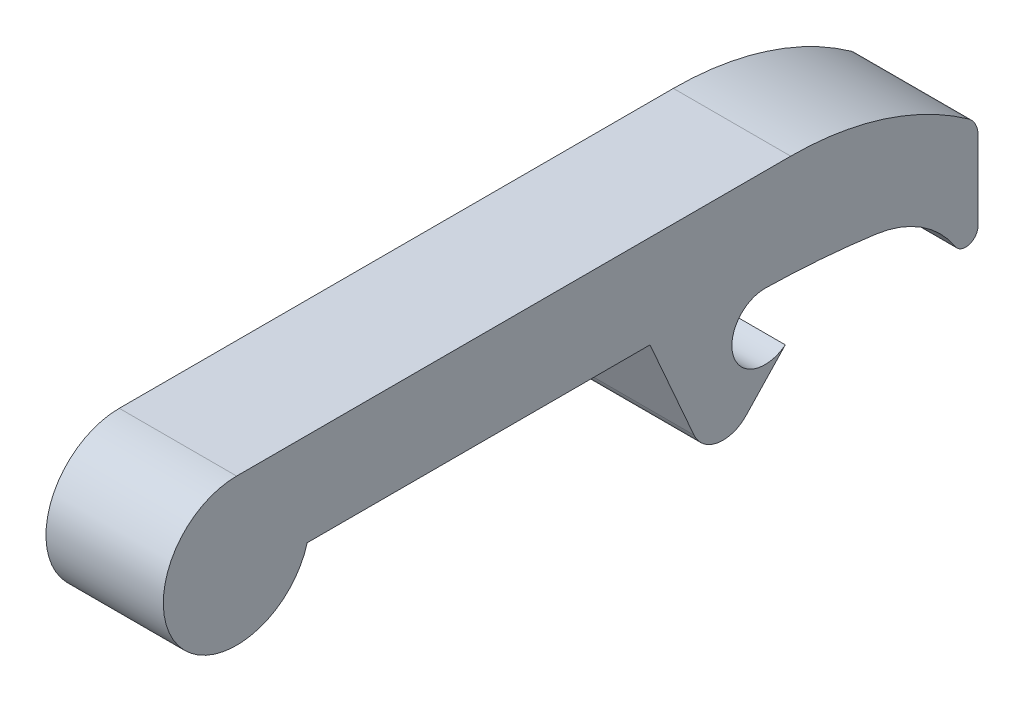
ISO-10303-21;
HEADER;
FILE_DESCRIPTION(('STEP AP214'),'2;1');
FILE_NAME('part.step','',(''),(''),'','','');
FILE_SCHEMA(('AUTOMOTIVE_DESIGN { 1 0 10303 214 1 1 1 1 }'));
ENDSEC;
DATA;
#1=APPLICATION_CONTEXT('core data for automotive mechanical design processes');
#2=APPLICATION_PROTOCOL_DEFINITION('international standard','automotive_design',2000,#1);
#3=PRODUCT_CONTEXT('',#1,'mechanical');
#4=PRODUCT('Part','Part','',(#3));
#5=PRODUCT_RELATED_PRODUCT_CATEGORY('part','',(#4));
#6=PRODUCT_DEFINITION_FORMATION('','',#4);
#7=PRODUCT_DEFINITION_CONTEXT('part definition',#1,'design');
#8=PRODUCT_DEFINITION('design','',#6,#7);
#9=PRODUCT_DEFINITION_SHAPE('','',#8);
#10=(LENGTH_UNIT() NAMED_UNIT(*) SI_UNIT(.MILLI.,.METRE.));
#11=(NAMED_UNIT(*) PLANE_ANGLE_UNIT() SI_UNIT($,.RADIAN.));
#12=(NAMED_UNIT(*) SI_UNIT($,.STERADIAN.) SOLID_ANGLE_UNIT());
#13=UNCERTAINTY_MEASURE_WITH_UNIT(LENGTH_MEASURE(1.E-05),#10,'distance_accuracy_value','');
#14=(GEOMETRIC_REPRESENTATION_CONTEXT(3) GLOBAL_UNCERTAINTY_ASSIGNED_CONTEXT((#13)) GLOBAL_UNIT_ASSIGNED_CONTEXT((#10,
#11,#12)) REPRESENTATION_CONTEXT('',''));
#15=CARTESIAN_POINT('',(0.,0.,0.));
#16=DIRECTION('',(0.,0.,1.));
#17=DIRECTION('',(1.,0.,0.));
#18=AXIS2_PLACEMENT_3D('',#15,#16,#17);
#19=CARTESIAN_POINT('',(31.75,-18.2904528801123,286.195239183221));
#20=DIRECTION('',(-1.,0.,0.));
#21=DIRECTION('',(0.,0.,1.));
#22=AXIS2_PLACEMENT_3D('',#19,#20,#21);
#23=CYLINDRICAL_SURFACE('',#22,39.6691923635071);
#24=CARTESIAN_POINT('',(-31.75,-18.2904528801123,286.195239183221));
#25=DIRECTION('',(1.,0.,0.));
#26=DIRECTION('',(0.,0.,-1.));
#27=AXIS2_PLACEMENT_3D('',#24,#25,#26);
#28=CIRCLE('',#27,39.6691923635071);
#29=CARTESIAN_POINT('',(-31.75,21.3787394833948,286.195239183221));
#30=VERTEX_POINT('',#29);
#31=CARTESIAN_POINT('',(-31.75,-28.9798226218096,247.99337800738));
#32=VERTEX_POINT('',#31);
#33=EDGE_CURVE('E159',#30,#32,#28,.T.);
#34=ORIENTED_EDGE('',*,*,#33,.T.);
#35=DIRECTION('',(-1.,0.,0.));
#36=VECTOR('',#35,1.);
#37=CARTESIAN_POINT('',(31.75,-28.9798226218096,247.99337800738));
#38=LINE('',#37,#36);
#39=CARTESIAN_POINT('',(31.75,-28.9798226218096,247.99337800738));
#40=VERTEX_POINT('',#39);
#41=EDGE_CURVE('E11',#40,#32,#38,.T.);
#42=ORIENTED_EDGE('',*,*,#41,.F.);
#43=CARTESIAN_POINT('',(31.75,-18.2904528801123,286.195239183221));
#44=DIRECTION('',(1.,0.,0.));
#45=DIRECTION('',(0.,0.,-1.));
#46=AXIS2_PLACEMENT_3D('',#43,#44,#45);
#47=CIRCLE('',#46,39.6691923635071);
#48=CARTESIAN_POINT('',(31.75,21.3787394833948,286.195239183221));
#49=VERTEX_POINT('',#48);
#50=EDGE_CURVE('E183',#49,#40,#47,.T.);
#51=ORIENTED_EDGE('',*,*,#50,.F.);
#52=DIRECTION('',(-1.,0.,0.));
#53=VECTOR('',#52,1.);
#54=CARTESIAN_POINT('',(31.75,21.3787394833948,286.195239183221));
#55=LINE('',#54,#53);
#56=EDGE_CURVE('E155',#49,#30,#55,.T.);
#57=ORIENTED_EDGE('',*,*,#56,.T.);
#58=EDGE_LOOP('',(#34,#42,#51,#57));
#59=FACE_BOUND('',#58,.T.);
#60=ADVANCED_FACE('F33',(#59),#23,.T.);
#61=CARTESIAN_POINT('',(31.75,-28.9798226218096,62.5236476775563));
#62=DIRECTION('',(0.,1.,0.));
#63=DIRECTION('',(0.,0.,1.));
#64=AXIS2_PLACEMENT_3D('',#61,#62,#63);
#65=PLANE('',#64);
#66=DIRECTION('',(0.,0.,-1.));
#67=VECTOR('',#66,1.);
#68=CARTESIAN_POINT('',(-31.75,-28.9798226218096,62.5236476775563));
#69=LINE('',#68,#67);
#70=CARTESIAN_POINT('',(-31.75,-28.9798226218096,62.5236476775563));
#71=VERTEX_POINT('',#70);
#72=EDGE_CURVE('E162',#32,#71,#69,.T.);
#73=ORIENTED_EDGE('',*,*,#72,.T.);
#74=DIRECTION('',(-1.,0.,0.));
#75=VECTOR('',#74,1.);
#76=CARTESIAN_POINT('',(31.75,-28.9798226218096,62.5236476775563));
#77=LINE('',#76,#75);
#78=CARTESIAN_POINT('',(31.75,-28.9798226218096,62.5236476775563));
#79=VERTEX_POINT('',#78);
#80=EDGE_CURVE('E41',#79,#71,#77,.T.);
#81=ORIENTED_EDGE('',*,*,#80,.F.);
#82=DIRECTION('',(0.,0.,-1.));
#83=VECTOR('',#82,1.);
#84=CARTESIAN_POINT('',(31.75,-28.9798226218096,62.5236476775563));
#85=LINE('',#84,#83);
#86=EDGE_CURVE('E107',#40,#79,#85,.T.);
#87=ORIENTED_EDGE('',*,*,#86,.F.);
#88=ORIENTED_EDGE('',*,*,#41,.T.);
#89=EDGE_LOOP('',(#73,#81,#87,#88));
#90=FACE_BOUND('',#89,.T.);
#91=ADVANCED_FACE('F266',(#90),#65,.F.);
#92=CARTESIAN_POINT('',(31.75,-83.2179374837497,38.6844172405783));
#93=DIRECTION('',(0.,0.40237741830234,-0.9154738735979));
#94=DIRECTION('',(0.,0.9154738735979,0.40237741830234));
#95=AXIS2_PLACEMENT_3D('',#92,#93,#94);
#96=PLANE('',#95);
#97=DIRECTION('',(0.,-0.9154738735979,-0.40237741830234));
#98=VECTOR('',#97,1.);
#99=CARTESIAN_POINT('',(-31.75,-83.2179374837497,38.6844172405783));
#100=LINE('',#99,#98);
#101=CARTESIAN_POINT('',(-31.75,-83.2179374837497,38.6844172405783));
#102=VERTEX_POINT('',#101);
#103=EDGE_CURVE('E164',#71,#102,#100,.T.);
#104=ORIENTED_EDGE('',*,*,#103,.T.);
#105=DIRECTION('',(-1.,0.,0.));
#106=VECTOR('',#105,1.);
#107=CARTESIAN_POINT('',(31.75,-83.2179374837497,38.6844172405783));
#108=LINE('',#107,#106);
#109=CARTESIAN_POINT('',(31.75,-83.2179374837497,38.6844172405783));
#110=VERTEX_POINT('',#109);
#111=EDGE_CURVE('E205',#110,#102,#108,.T.);
#112=ORIENTED_EDGE('',*,*,#111,.F.);
#113=DIRECTION('',(0.,-0.9154738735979,-0.40237741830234));
#114=VECTOR('',#113,1.);
#115=CARTESIAN_POINT('',(31.75,-83.2179374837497,38.6844172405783));
#116=LINE('',#115,#114);
#117=EDGE_CURVE('E213',#79,#110,#116,.T.);
#118=ORIENTED_EDGE('',*,*,#117,.F.);
#119=ORIENTED_EDGE('',*,*,#80,.T.);
#120=EDGE_LOOP('',(#104,#112,#118,#119));
#121=FACE_BOUND('',#120,.T.);
#122=ADVANCED_FACE('F211',(#121),#96,.F.);
#123=CARTESIAN_POINT('',(31.75,-76.3212880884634,22.9934215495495));
#124=DIRECTION('',(-1.,0.,0.));
#125=DIRECTION('',(0.,0.,1.));
#126=AXIS2_PLACEMENT_3D('',#123,#124,#125);
#127=CYLINDRICAL_SURFACE('',#126,17.1397525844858);
#128=CARTESIAN_POINT('',(-31.75,-76.3212880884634,22.9934215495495));
#129=DIRECTION('',(1.,0.,0.));
#130=DIRECTION('',(0.,0.,1.));
#131=AXIS2_PLACEMENT_3D('',#128,#129,#130);
#132=CIRCLE('',#131,17.1397525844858);
#133=CARTESIAN_POINT('',(-31.75,-88.0789591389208,10.5223233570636));
#134=VERTEX_POINT('',#133);
#135=EDGE_CURVE('E166',#102,#134,#132,.T.);
#136=ORIENTED_EDGE('',*,*,#135,.T.);
#137=DIRECTION('',(-1.,0.,0.));
#138=VECTOR('',#137,1.);
#139=CARTESIAN_POINT('',(31.75,-88.0789591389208,10.5223233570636));
#140=LINE('',#139,#138);
#141=CARTESIAN_POINT('',(31.75,-88.0789591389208,10.5223233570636));
#142=VERTEX_POINT('',#141);
#143=EDGE_CURVE('E202',#142,#134,#140,.T.);
#144=ORIENTED_EDGE('',*,*,#143,.F.);
#145=CARTESIAN_POINT('',(31.75,-76.3212880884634,22.9934215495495));
#146=DIRECTION('',(1.,0.,0.));
#147=DIRECTION('',(0.,0.,1.));
#148=AXIS2_PLACEMENT_3D('',#145,#146,#147);
#149=CIRCLE('',#148,17.1397525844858);
#150=EDGE_CURVE('E231',#110,#142,#149,.T.);
#151=ORIENTED_EDGE('',*,*,#150,.F.);
#152=ORIENTED_EDGE('',*,*,#111,.T.);
#153=EDGE_LOOP('',(#136,#144,#151,#152));
#154=FACE_BOUND('',#153,.T.);
#155=ADVANCED_FACE('F222',(#154),#127,.T.);
#156=CARTESIAN_POINT('',(31.75,-65.5801916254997,-10.6893697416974));
#157=DIRECTION('',(0.,0.685988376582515,0.727612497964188));
#158=DIRECTION('',(0.,-0.727612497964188,0.685988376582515));
#159=AXIS2_PLACEMENT_3D('',#156,#157,#158);
#160=PLANE('',#159);
#161=DIRECTION('',(0.,0.727612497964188,-0.685988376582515));
#162=VECTOR('',#161,1.);
#163=CARTESIAN_POINT('',(-31.75,-65.5801916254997,-10.6893697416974));
#164=LINE('',#163,#162);
#165=CARTESIAN_POINT('',(-31.75,-65.5801916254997,-10.6893697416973));
#166=VERTEX_POINT('',#165);
#167=EDGE_CURVE('E168',#134,#166,#164,.T.);
#168=ORIENTED_EDGE('',*,*,#167,.T.);
#169=DIRECTION('',(-1.,0.,0.));
#170=VECTOR('',#169,1.);
#171=CARTESIAN_POINT('',(31.75,-65.5801916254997,-10.6893697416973));
#172=LINE('',#171,#170);
#173=CARTESIAN_POINT('',(31.75,-65.5801916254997,-10.6893697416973));
#174=VERTEX_POINT('',#173);
#175=EDGE_CURVE('E199',#174,#166,#172,.T.);
#176=ORIENTED_EDGE('',*,*,#175,.F.);
#177=DIRECTION('',(0.,0.727612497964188,-0.685988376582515));
#178=VECTOR('',#177,1.);
#179=CARTESIAN_POINT('',(31.75,-65.5801916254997,-10.6893697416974));
#180=LINE('',#179,#178);
#181=EDGE_CURVE('E228',#142,#174,#180,.T.);
#182=ORIENTED_EDGE('',*,*,#181,.F.);
#183=ORIENTED_EDGE('',*,*,#143,.T.);
#184=EDGE_LOOP('',(#168,#176,#182,#183));
#185=FACE_BOUND('',#184,.T.);
#186=ADVANCED_FACE('F226',(#185),#160,.F.);
#187=CARTESIAN_POINT('',(31.75,-51.4973439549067,0.329066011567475));
#188=DIRECTION('',(-1.,0.,0.));
#189=DIRECTION('',(0.,0.,1.));
#190=AXIS2_PLACEMENT_3D('',#187,#188,#189);
#191=CYLINDRICAL_SURFACE('',#190,17.8810661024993);
#192=CARTESIAN_POINT('',(-31.75,-51.4973439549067,0.329066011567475));
#193=DIRECTION('',(-1.,0.,0.));
#194=DIRECTION('',(0.,0.,-1.));
#195=AXIS2_PLACEMENT_3D('',#192,#193,#194);
#196=CIRCLE('',#195,17.8810661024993);
#197=CARTESIAN_POINT('',(-31.75,-33.6193060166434,0.));
#198=VERTEX_POINT('',#197);
#199=EDGE_CURVE('E170',#166,#198,#196,.T.);
#200=ORIENTED_EDGE('',*,*,#199,.T.);
#201=DIRECTION('',(-1.,0.,0.));
#202=VECTOR('',#201,1.);
#203=CARTESIAN_POINT('',(31.75,-33.6193060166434,0.));
#204=LINE('',#203,#202);
#205=CARTESIAN_POINT('',(31.75,-33.6193060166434,0.));
#206=VERTEX_POINT('',#205);
#207=EDGE_CURVE('E196',#206,#198,#204,.T.);
#208=ORIENTED_EDGE('',*,*,#207,.F.);
#209=CARTESIAN_POINT('',(31.75,-51.4973439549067,0.329066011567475));
#210=DIRECTION('',(-1.,0.,0.));
#211=DIRECTION('',(0.,0.,-1.));
#212=AXIS2_PLACEMENT_3D('',#209,#210,#211);
#213=CIRCLE('',#212,17.8810661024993);
#214=EDGE_CURVE('E230',#174,#206,#213,.T.);
#215=ORIENTED_EDGE('',*,*,#214,.F.);
#216=ORIENTED_EDGE('',*,*,#175,.T.);
#217=EDGE_LOOP('',(#200,#208,#215,#216));
#218=FACE_BOUND('',#217,.T.);
#219=ADVANCED_FACE('F279',(#218),#191,.F.);
#220=CARTESIAN_POINT('',(31.75,-541.879675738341,9.35512125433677));
#221=DIRECTION('',(-1.,0.,0.));
#222=DIRECTION('',(0.,0.,1.));
#223=AXIS2_PLACEMENT_3D('',#220,#221,#222);
#224=CYLINDRICAL_SURFACE('',#223,508.346458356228);
#225=CARTESIAN_POINT('',(-31.75,-541.879675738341,9.35512125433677));
#226=DIRECTION('',(-1.,0.,0.));
#227=DIRECTION('',(0.,0.,-1.));
#228=AXIS2_PLACEMENT_3D('',#225,#226,#227);
#229=CIRCLE('',#228,508.346458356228);
#230=CARTESIAN_POINT('',(-31.75,-38.2587894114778,-59.7977859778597));
#231=VERTEX_POINT('',#230);
#232=EDGE_CURVE('E172',#198,#231,#229,.T.);
#233=ORIENTED_EDGE('',*,*,#232,.T.);
#234=DIRECTION('',(-1.,0.,0.));
#235=VECTOR('',#234,1.);
#236=CARTESIAN_POINT('',(31.75,-38.2587894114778,-59.7977859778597));
#237=LINE('',#236,#235);
#238=CARTESIAN_POINT('',(31.75,-38.2587894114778,-59.7977859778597));
#239=VERTEX_POINT('',#238);
#240=EDGE_CURVE('E193',#239,#231,#237,.T.);
#241=ORIENTED_EDGE('',*,*,#240,.F.);
#242=CARTESIAN_POINT('',(31.75,-541.879675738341,9.35512125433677));
#243=DIRECTION('',(-1.,0.,0.));
#244=DIRECTION('',(0.,0.,-1.));
#245=AXIS2_PLACEMENT_3D('',#242,#243,#244);
#246=CIRCLE('',#245,508.346458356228);
#247=EDGE_CURVE('E233',#206,#239,#246,.T.);
#248=ORIENTED_EDGE('',*,*,#247,.F.);
#249=ORIENTED_EDGE('',*,*,#207,.T.);
#250=EDGE_LOOP('',(#233,#241,#248,#249));
#251=FACE_BOUND('',#250,.T.);
#252=ADVANCED_FACE('F282',(#251),#224,.F.);
#253=CARTESIAN_POINT('',(31.75,-98.6662997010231,-51.503143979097));
#254=DIRECTION('',(-1.,0.,0.));
#255=DIRECTION('',(0.,0.,1.));
#256=AXIS2_PLACEMENT_3D('',#253,#254,#255);
#257=CYLINDRICAL_SURFACE('',#256,60.9743256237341);
#258=CARTESIAN_POINT('',(-31.75,-98.6662997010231,-51.503143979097));
#259=DIRECTION('',(-1.,0.,0.));
#260=DIRECTION('',(0.,0.,-1.));
#261=AXIS2_PLACEMENT_3D('',#258,#259,#260);
#262=CIRCLE('',#261,60.9743256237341);
#263=CARTESIAN_POINT('',(-31.75,-65.5801916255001,-102.720112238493));
#264=VERTEX_POINT('',#263);
#265=EDGE_CURVE('E174',#231,#264,#262,.T.);
#266=ORIENTED_EDGE('',*,*,#265,.T.);
#267=DIRECTION('',(-1.,0.,0.));
#268=VECTOR('',#267,1.);
#269=CARTESIAN_POINT('',(31.75,-65.5801916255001,-102.720112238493));
#270=LINE('',#269,#268);
#271=CARTESIAN_POINT('',(31.75,-65.5801916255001,-102.720112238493));
#272=VERTEX_POINT('',#271);
#273=EDGE_CURVE('E190',#272,#264,#270,.T.);
#274=ORIENTED_EDGE('',*,*,#273,.F.);
#275=CARTESIAN_POINT('',(31.75,-98.6662997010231,-51.503143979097));
#276=DIRECTION('',(-1.,0.,0.));
#277=DIRECTION('',(0.,0.,-1.));
#278=AXIS2_PLACEMENT_3D('',#275,#276,#277);
#279=CIRCLE('',#278,60.9743256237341);
#280=EDGE_CURVE('E239',#239,#272,#279,.T.);
#281=ORIENTED_EDGE('',*,*,#280,.F.);
#282=ORIENTED_EDGE('',*,*,#240,.T.);
#283=EDGE_LOOP('',(#266,#274,#281,#282));
#284=FACE_BOUND('',#283,.T.);
#285=ADVANCED_FACE('F286',(#284),#257,.F.);
#286=CARTESIAN_POINT('',(31.75,-61.9717045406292,-108.306014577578));
#287=DIRECTION('',(-1.,0.,0.));
#288=DIRECTION('',(0.,0.,1.));
#289=AXIS2_PLACEMENT_3D('',#286,#287,#288);
#290=CYLINDRICAL_SURFACE('',#289,6.65007398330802);
#291=CARTESIAN_POINT('',(-31.75,-61.9717045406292,-108.306014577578));
#292=DIRECTION('',(1.,0.,0.));
#293=DIRECTION('',(0.,0.,1.));
#294=AXIS2_PLACEMENT_3D('',#291,#292,#293);
#295=CIRCLE('',#294,6.65007398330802);
#296=CARTESIAN_POINT('',(-31.75,-61.9717045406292,-114.956088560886));
#297=VERTEX_POINT('',#296);
#298=EDGE_CURVE('E176',#264,#297,#295,.T.);
#299=ORIENTED_EDGE('',*,*,#298,.T.);
#300=DIRECTION('',(-1.,0.,0.));
#301=VECTOR('',#300,1.);
#302=CARTESIAN_POINT('',(31.75,-61.9717045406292,-114.956088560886));
#303=LINE('',#302,#301);
#304=CARTESIAN_POINT('',(31.75,-61.9717045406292,-114.956088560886));
#305=VERTEX_POINT('',#304);
#306=EDGE_CURVE('E187',#305,#297,#303,.T.);
#307=ORIENTED_EDGE('',*,*,#306,.F.);
#308=CARTESIAN_POINT('',(31.75,-61.9717045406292,-108.306014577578));
#309=DIRECTION('',(1.,0.,0.));
#310=DIRECTION('',(0.,0.,1.));
#311=AXIS2_PLACEMENT_3D('',#308,#309,#310);
#312=CIRCLE('',#311,6.65007398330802);
#313=EDGE_CURVE('E241',#272,#305,#312,.T.);
#314=ORIENTED_EDGE('',*,*,#313,.F.);
#315=ORIENTED_EDGE('',*,*,#273,.T.);
#316=EDGE_LOOP('',(#299,#307,#314,#315));
#317=FACE_BOUND('',#316,.T.);
#318=ADVANCED_FACE('F247',(#317),#290,.T.);
#319=CARTESIAN_POINT('',(31.75,-19.2578760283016,-114.956088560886));
#320=DIRECTION('',(0.,0.,1.));
#321=DIRECTION('',(0.,-1.,0.));
#322=AXIS2_PLACEMENT_3D('',#319,#320,#321);
#323=PLANE('',#322);
#324=DIRECTION('',(0.,1.,0.));
#325=VECTOR('',#324,1.);
#326=CARTESIAN_POINT('',(-31.75,-19.2578760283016,-114.956088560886));
#327=LINE('',#326,#325);
#328=CARTESIAN_POINT('',(-31.75,-19.2578760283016,-114.956088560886));
#329=VERTEX_POINT('',#328);
#330=EDGE_CURVE('E178',#297,#329,#327,.T.);
#331=ORIENTED_EDGE('',*,*,#330,.T.);
#332=DIRECTION('',(-1.,0.,0.));
#333=VECTOR('',#332,1.);
#334=CARTESIAN_POINT('',(31.75,-19.2578760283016,-114.956088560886));
#335=LINE('',#334,#333);
#336=CARTESIAN_POINT('',(31.75,-19.2578760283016,-114.956088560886));
#337=VERTEX_POINT('',#336);
#338=EDGE_CURVE('E150',#337,#329,#335,.T.);
#339=ORIENTED_EDGE('',*,*,#338,.F.);
#340=DIRECTION('',(0.,1.,0.));
#341=VECTOR('',#340,1.);
#342=CARTESIAN_POINT('',(31.75,-19.2578760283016,-114.956088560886));
#343=LINE('',#342,#341);
#344=EDGE_CURVE('E141',#305,#337,#343,.T.);
#345=ORIENTED_EDGE('',*,*,#344,.F.);
#346=ORIENTED_EDGE('',*,*,#306,.T.);
#347=EDGE_LOOP('',(#331,#339,#345,#346));
#348=FACE_BOUND('',#347,.T.);
#349=ADVANCED_FACE('F251',(#348),#323,.F.);
#350=CARTESIAN_POINT('',(31.75,-19.2578760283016,-102.720112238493));
#351=DIRECTION('',(-1.,0.,0.));
#352=DIRECTION('',(0.,0.,1.));
#353=AXIS2_PLACEMENT_3D('',#350,#351,#352);
#354=CYLINDRICAL_SURFACE('',#353,12.2359763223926);
#355=CARTESIAN_POINT('',(-31.75,-19.2578760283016,-102.720112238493));
#356=DIRECTION('',(1.,0.,0.));
#357=DIRECTION('',(0.,0.,1.));
#358=AXIS2_PLACEMENT_3D('',#355,#356,#357);
#359=CIRCLE('',#358,12.2359763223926);
#360=CARTESIAN_POINT('',(-31.75,-9.27896678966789,-109.80110701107));
#361=VERTEX_POINT('',#360);
#362=EDGE_CURVE('E149',#329,#361,#359,.T.);
#363=ORIENTED_EDGE('',*,*,#362,.T.);
#364=DIRECTION('',(-1.,0.,0.));
#365=VECTOR('',#364,1.);
#366=CARTESIAN_POINT('',(31.75,-9.27896678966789,-109.80110701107));
#367=LINE('',#366,#365);
#368=CARTESIAN_POINT('',(31.75,-9.27896678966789,-109.80110701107));
#369=VERTEX_POINT('',#368);
#370=EDGE_CURVE('E146',#369,#361,#367,.T.);
#371=ORIENTED_EDGE('',*,*,#370,.F.);
#372=CARTESIAN_POINT('',(31.75,-19.2578760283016,-102.720112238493));
#373=DIRECTION('',(1.,0.,0.));
#374=DIRECTION('',(0.,0.,1.));
#375=AXIS2_PLACEMENT_3D('',#372,#373,#374);
#376=CIRCLE('',#375,12.2359763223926);
#377=EDGE_CURVE('E135',#337,#369,#376,.T.);
#378=ORIENTED_EDGE('',*,*,#377,.F.);
#379=ORIENTED_EDGE('',*,*,#338,.T.);
#380=EDGE_LOOP('',(#363,#371,#378,#379));
#381=FACE_BOUND('',#380,.T.);
#382=ADVANCED_FACE('F147',(#381),#354,.T.);
#383=CARTESIAN_POINT('',(31.75,-144.82233214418,-13.6200677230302));
#384=DIRECTION('',(-1.,0.,0.));
#385=DIRECTION('',(0.,0.,1.));
#386=AXIS2_PLACEMENT_3D('',#383,#384,#385);
#387=CYLINDRICAL_SURFACE('',#386,166.201071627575);
#388=CARTESIAN_POINT('',(-31.75,-144.82233214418,-13.6200677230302));
#389=DIRECTION('',(1.,0.,0.));
#390=DIRECTION('',(0.,0.,1.));
#391=AXIS2_PLACEMENT_3D('',#388,#389,#390);
#392=CIRCLE('',#391,166.201071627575);
#393=CARTESIAN_POINT('',(-31.75,21.3787394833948,-13.6200677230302));
#394=VERTEX_POINT('',#393);
#395=EDGE_CURVE('E93',#361,#394,#392,.T.);
#396=ORIENTED_EDGE('',*,*,#395,.T.);
#397=DIRECTION('',(-1.,0.,0.));
#398=VECTOR('',#397,1.);
#399=CARTESIAN_POINT('',(31.75,21.3787394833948,-13.6200677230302));
#400=LINE('',#399,#398);
#401=CARTESIAN_POINT('',(31.75,21.3787394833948,-13.6200677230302));
#402=VERTEX_POINT('',#401);
#403=EDGE_CURVE('E151',#402,#394,#400,.T.);
#404=ORIENTED_EDGE('',*,*,#403,.F.);
#405=CARTESIAN_POINT('',(31.75,-144.82233214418,-13.6200677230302));
#406=DIRECTION('',(1.,0.,0.));
#407=DIRECTION('',(0.,0.,1.));
#408=AXIS2_PLACEMENT_3D('',#405,#406,#407);
#409=CIRCLE('',#408,166.201071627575);
#410=EDGE_CURVE('E139',#369,#402,#409,.T.);
#411=ORIENTED_EDGE('',*,*,#410,.F.);
#412=ORIENTED_EDGE('',*,*,#370,.T.);
#413=EDGE_LOOP('',(#396,#404,#411,#412));
#414=FACE_BOUND('',#413,.T.);
#415=ADVANCED_FACE('F153',(#414),#387,.T.);
#416=CARTESIAN_POINT('',(31.75,21.3787394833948,286.195239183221));
#417=DIRECTION('',(0.,-1.,0.));
#418=DIRECTION('',(0.,0.,-1.));
#419=AXIS2_PLACEMENT_3D('',#416,#417,#418);
#420=PLANE('',#419);
#421=DIRECTION('',(0.,0.,1.));
#422=VECTOR('',#421,1.);
#423=CARTESIAN_POINT('',(-31.75,21.3787394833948,286.195239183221));
#424=LINE('',#423,#422);
#425=EDGE_CURVE('E99',#394,#30,#424,.T.);
#426=ORIENTED_EDGE('',*,*,#425,.T.);
#427=ORIENTED_EDGE('',*,*,#56,.F.);
#428=DIRECTION('',(0.,0.,1.));
#429=VECTOR('',#428,1.);
#430=CARTESIAN_POINT('',(31.75,21.3787394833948,286.195239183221));
#431=LINE('',#430,#429);
#432=EDGE_CURVE('E49',#402,#49,#431,.T.);
#433=ORIENTED_EDGE('',*,*,#432,.F.);
#434=ORIENTED_EDGE('',*,*,#403,.T.);
#435=EDGE_LOOP('',(#426,#427,#433,#434));
#436=FACE_BOUND('',#435,.T.);
#437=ADVANCED_FACE('F255',(#436),#420,.F.);
#438=CARTESIAN_POINT('',(31.75,-18.2904528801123,286.195239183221));
#439=DIRECTION('',(1.,0.,0.));
#440=DIRECTION('',(0.,0.,-1.));
#441=AXIS2_PLACEMENT_3D('',#438,#439,#440);
#442=PLANE('',#441);
#443=ORIENTED_EDGE('',*,*,#50,.T.);
#444=ORIENTED_EDGE('',*,*,#86,.T.);
#445=ORIENTED_EDGE('',*,*,#117,.T.);
#446=ORIENTED_EDGE('',*,*,#150,.T.);
#447=ORIENTED_EDGE('',*,*,#181,.T.);
#448=ORIENTED_EDGE('',*,*,#214,.T.);
#449=ORIENTED_EDGE('',*,*,#247,.T.);
#450=ORIENTED_EDGE('',*,*,#280,.T.);
#451=ORIENTED_EDGE('',*,*,#313,.T.);
#452=ORIENTED_EDGE('',*,*,#344,.T.);
#453=ORIENTED_EDGE('',*,*,#377,.T.);
#454=ORIENTED_EDGE('',*,*,#410,.T.);
#455=ORIENTED_EDGE('',*,*,#432,.T.);
#456=EDGE_LOOP('',(#443,#444,#445,#446,#447,#448,#449,#450,#451,#452,#453,#454,#455));
#457=FACE_BOUND('',#456,.T.);
#458=ADVANCED_FACE('F137',(#457),#442,.T.);
#459=CARTESIAN_POINT('',(-31.75,-18.2904528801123,286.195239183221));
#460=DIRECTION('',(1.,0.,0.));
#461=DIRECTION('',(0.,0.,-1.));
#462=AXIS2_PLACEMENT_3D('',#459,#460,#461);
#463=PLANE('',#462);
#464=ORIENTED_EDGE('',*,*,#33,.F.);
#465=ORIENTED_EDGE('',*,*,#425,.F.);
#466=ORIENTED_EDGE('',*,*,#395,.F.);
#467=ORIENTED_EDGE('',*,*,#362,.F.);
#468=ORIENTED_EDGE('',*,*,#330,.F.);
#469=ORIENTED_EDGE('',*,*,#298,.F.);
#470=ORIENTED_EDGE('',*,*,#265,.F.);
#471=ORIENTED_EDGE('',*,*,#232,.F.);
#472=ORIENTED_EDGE('',*,*,#199,.F.);
#473=ORIENTED_EDGE('',*,*,#167,.F.);
#474=ORIENTED_EDGE('',*,*,#135,.F.);
#475=ORIENTED_EDGE('',*,*,#103,.F.);
#476=ORIENTED_EDGE('',*,*,#72,.F.);
#477=EDGE_LOOP('',(#464,#465,#466,#467,#468,#469,#470,#471,#472,#473,#474,#475,#476));
#478=FACE_BOUND('',#477,.T.);
#479=ADVANCED_FACE('F217',(#478),#463,.F.);
#480=CLOSED_SHELL('',(#60,#91,#122,#155,#186,#219,#252,#285,#318,#349,#382,#415,#437,#458,#479));
#481=MANIFOLD_SOLID_BREP('B2',#480);
#482=ADVANCED_BREP_SHAPE_REPRESENTATION('',(#18,#481),#14);
#483=SHAPE_DEFINITION_REPRESENTATION(#9,#482);
ENDSEC;
END-ISO-10303-21;
